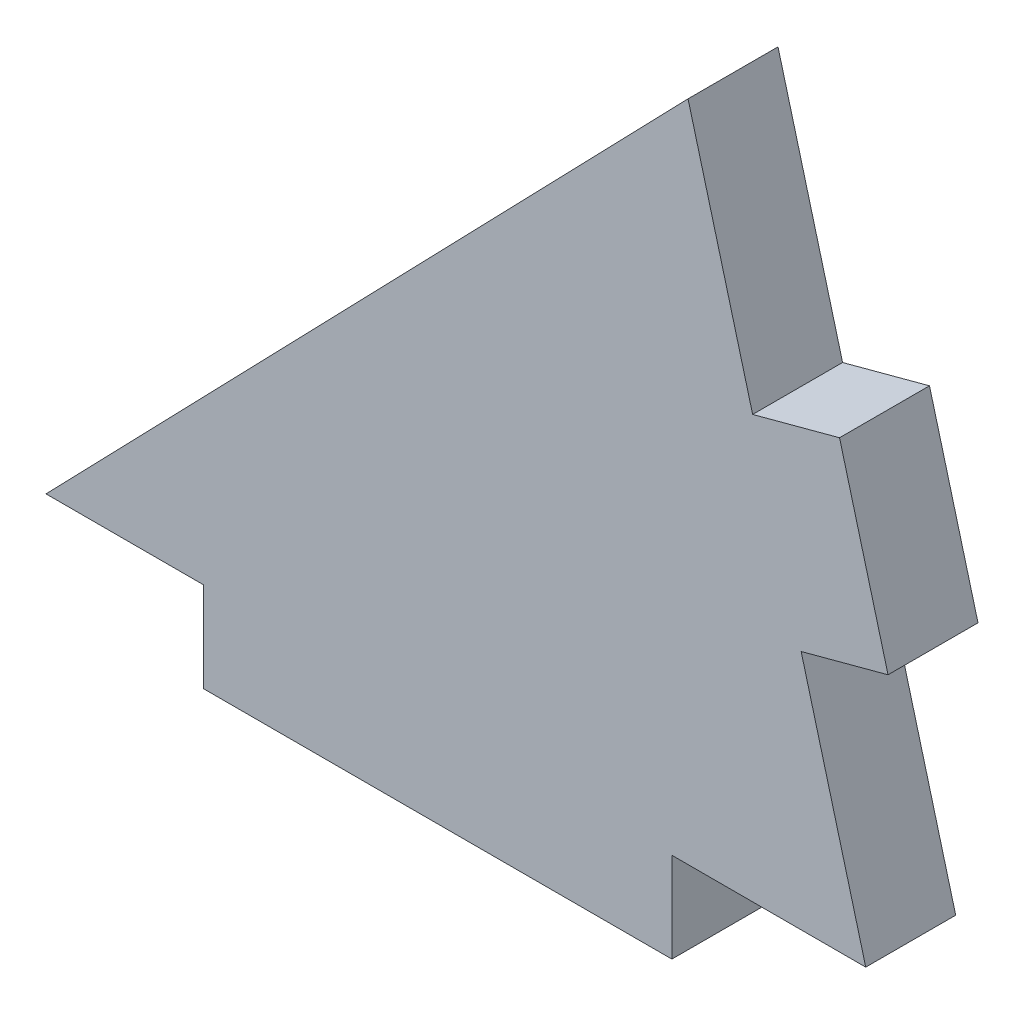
ISO-10303-21;
HEADER;
FILE_DESCRIPTION(('STEP AP214'),'2;1');
FILE_NAME('part.step','',(''),(''),'','','');
FILE_SCHEMA(('AUTOMOTIVE_DESIGN { 1 0 10303 214 1 1 1 1 }'));
ENDSEC;
DATA;
#1=APPLICATION_CONTEXT('core data for automotive mechanical design processes');
#2=APPLICATION_PROTOCOL_DEFINITION('international standard','automotive_design',2000,#1);
#3=PRODUCT_CONTEXT('',#1,'mechanical');
#4=PRODUCT('Part','Part','',(#3));
#5=PRODUCT_RELATED_PRODUCT_CATEGORY('part','',(#4));
#6=PRODUCT_DEFINITION_FORMATION('','',#4);
#7=PRODUCT_DEFINITION_CONTEXT('part definition',#1,'design');
#8=PRODUCT_DEFINITION('design','',#6,#7);
#9=PRODUCT_DEFINITION_SHAPE('','',#8);
#10=(LENGTH_UNIT() NAMED_UNIT(*) SI_UNIT(.MILLI.,.METRE.));
#11=(NAMED_UNIT(*) PLANE_ANGLE_UNIT() SI_UNIT($,.RADIAN.));
#12=(NAMED_UNIT(*) SI_UNIT($,.STERADIAN.) SOLID_ANGLE_UNIT());
#13=UNCERTAINTY_MEASURE_WITH_UNIT(LENGTH_MEASURE(1.E-05),#10,'distance_accuracy_value','');
#14=(GEOMETRIC_REPRESENTATION_CONTEXT(3) GLOBAL_UNCERTAINTY_ASSIGNED_CONTEXT((#13)) GLOBAL_UNIT_ASSIGNED_CONTEXT((#10,
#11,#12)) REPRESENTATION_CONTEXT('',''));
#15=CARTESIAN_POINT('',(0.,0.,0.));
#16=DIRECTION('',(0.,0.,1.));
#17=DIRECTION('',(1.,0.,0.));
#18=AXIS2_PLACEMENT_3D('',#15,#16,#17);
#19=CARTESIAN_POINT('',(18.228516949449,0.,1.524));
#20=DIRECTION('',(0.,1.,0.));
#21=DIRECTION('',(0.,0.,1.));
#22=AXIS2_PLACEMENT_3D('',#19,#20,#21);
#23=PLANE('',#22);
#24=DIRECTION('',(1.,0.,0.));
#25=VECTOR('',#24,1.);
#26=CARTESIAN_POINT('',(18.228516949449,0.,0.));
#27=LINE('',#26,#25);
#28=CARTESIAN_POINT('',(15.5631506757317,0.,0.));
#29=VERTEX_POINT('',#28);
#30=CARTESIAN_POINT('',(18.228516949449,0.,0.));
#31=VERTEX_POINT('',#30);
#32=EDGE_CURVE('E150',#29,#31,#27,.T.);
#33=ORIENTED_EDGE('',*,*,#32,.T.);
#34=DIRECTION('',(0.,0.,-1.));
#35=VECTOR('',#34,1.);
#36=CARTESIAN_POINT('',(18.228516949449,0.,1.524));
#37=LINE('',#36,#35);
#38=CARTESIAN_POINT('',(18.228516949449,0.,1.524));
#39=VERTEX_POINT('',#38);
#40=EDGE_CURVE('E11',#39,#31,#37,.T.);
#41=ORIENTED_EDGE('',*,*,#40,.F.);
#42=DIRECTION('',(1.,0.,0.));
#43=VECTOR('',#42,1.);
#44=CARTESIAN_POINT('',(18.228516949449,0.,1.524));
#45=LINE('',#44,#43);
#46=CARTESIAN_POINT('',(15.5631506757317,0.,1.524));
#47=VERTEX_POINT('',#46);
#48=EDGE_CURVE('E170',#47,#39,#45,.T.);
#49=ORIENTED_EDGE('',*,*,#48,.F.);
#50=DIRECTION('',(0.,0.,-1.));
#51=VECTOR('',#50,1.);
#52=CARTESIAN_POINT('',(15.5631506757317,0.,1.524));
#53=LINE('',#52,#51);
#54=EDGE_CURVE('E146',#47,#29,#53,.T.);
#55=ORIENTED_EDGE('',*,*,#54,.T.);
#56=EDGE_LOOP('',(#33,#41,#49,#55));
#57=FACE_BOUND('',#56,.T.);
#58=ADVANCED_FACE('F36',(#57),#23,.F.);
#59=CARTESIAN_POINT('',(18.228516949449,0.,1.524));
#60=DIRECTION('',(1.,0.,0.));
#61=DIRECTION('',(0.,0.,-1.));
#62=AXIS2_PLACEMENT_3D('',#59,#60,#61);
#63=PLANE('',#62);
#64=DIRECTION('',(0.,-1.,0.));
#65=VECTOR('',#64,1.);
#66=CARTESIAN_POINT('',(18.228516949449,0.,0.));
#67=LINE('',#66,#65);
#68=CARTESIAN_POINT('',(18.228516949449,-1.524,0.));
#69=VERTEX_POINT('',#68);
#70=EDGE_CURVE('E153',#31,#69,#67,.T.);
#71=ORIENTED_EDGE('',*,*,#70,.T.);
#72=DIRECTION('',(0.,0.,-1.));
#73=VECTOR('',#72,1.);
#74=CARTESIAN_POINT('',(18.228516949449,-1.524,1.524));
#75=LINE('',#74,#73);
#76=CARTESIAN_POINT('',(18.228516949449,-1.524,1.524));
#77=VERTEX_POINT('',#76);
#78=EDGE_CURVE('E44',#77,#69,#75,.T.);
#79=ORIENTED_EDGE('',*,*,#78,.F.);
#80=DIRECTION('',(0.,-1.,0.));
#81=VECTOR('',#80,1.);
#82=CARTESIAN_POINT('',(18.228516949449,0.,1.524));
#83=LINE('',#82,#81);
#84=EDGE_CURVE('E104',#39,#77,#83,.T.);
#85=ORIENTED_EDGE('',*,*,#84,.F.);
#86=ORIENTED_EDGE('',*,*,#40,.T.);
#87=EDGE_LOOP('',(#71,#79,#85,#86));
#88=FACE_BOUND('',#87,.T.);
#89=ADVANCED_FACE('F242',(#88),#63,.F.);
#90=CARTESIAN_POINT('',(18.228516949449,-1.524,1.524));
#91=DIRECTION('',(0.,1.,0.));
#92=DIRECTION('',(0.,0.,1.));
#93=AXIS2_PLACEMENT_3D('',#90,#91,#92);
#94=PLANE('',#93);
#95=DIRECTION('',(1.,0.,0.));
#96=VECTOR('',#95,1.);
#97=CARTESIAN_POINT('',(18.228516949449,-1.524,0.));
#98=LINE('',#97,#96);
#99=CARTESIAN_POINT('',(26.166016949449,-1.524,0.));
#100=VERTEX_POINT('',#99);
#101=EDGE_CURVE('E155',#69,#100,#98,.T.);
#102=ORIENTED_EDGE('',*,*,#101,.T.);
#103=DIRECTION('',(0.,0.,-1.));
#104=VECTOR('',#103,1.);
#105=CARTESIAN_POINT('',(26.166016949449,-1.524,1.524));
#106=LINE('',#105,#104);
#107=CARTESIAN_POINT('',(26.166016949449,-1.524,1.524));
#108=VERTEX_POINT('',#107);
#109=EDGE_CURVE('E186',#108,#100,#106,.T.);
#110=ORIENTED_EDGE('',*,*,#109,.F.);
#111=DIRECTION('',(1.,0.,0.));
#112=VECTOR('',#111,1.);
#113=CARTESIAN_POINT('',(18.228516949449,-1.524,1.524));
#114=LINE('',#113,#112);
#115=EDGE_CURVE('E194',#77,#108,#114,.T.);
#116=ORIENTED_EDGE('',*,*,#115,.F.);
#117=ORIENTED_EDGE('',*,*,#78,.T.);
#118=EDGE_LOOP('',(#102,#110,#116,#117));
#119=FACE_BOUND('',#118,.T.);
#120=ADVANCED_FACE('F192',(#119),#94,.F.);
#121=CARTESIAN_POINT('',(26.166016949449,-1.524,1.524));
#122=DIRECTION('',(-1.,0.,0.));
#123=DIRECTION('',(0.,0.,1.));
#124=AXIS2_PLACEMENT_3D('',#121,#122,#123);
#125=PLANE('',#124);
#126=DIRECTION('',(0.,1.,0.));
#127=VECTOR('',#126,1.);
#128=CARTESIAN_POINT('',(26.166016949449,-1.524,0.));
#129=LINE('',#128,#127);
#130=CARTESIAN_POINT('',(26.166016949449,0.,0.));
#131=VERTEX_POINT('',#130);
#132=EDGE_CURVE('E157',#100,#131,#129,.T.);
#133=ORIENTED_EDGE('',*,*,#132,.T.);
#134=DIRECTION('',(0.,0.,-1.));
#135=VECTOR('',#134,1.);
#136=CARTESIAN_POINT('',(26.166016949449,0.,1.524));
#137=LINE('',#136,#135);
#138=CARTESIAN_POINT('',(26.166016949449,0.,1.524));
#139=VERTEX_POINT('',#138);
#140=EDGE_CURVE('E183',#139,#131,#137,.T.);
#141=ORIENTED_EDGE('',*,*,#140,.F.);
#142=DIRECTION('',(0.,1.,0.));
#143=VECTOR('',#142,1.);
#144=CARTESIAN_POINT('',(26.166016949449,-1.524,1.524));
#145=LINE('',#144,#143);
#146=EDGE_CURVE('E212',#108,#139,#145,.T.);
#147=ORIENTED_EDGE('',*,*,#146,.F.);
#148=ORIENTED_EDGE('',*,*,#109,.T.);
#149=EDGE_LOOP('',(#133,#141,#147,#148));
#150=FACE_BOUND('',#149,.T.);
#151=ADVANCED_FACE('F203',(#150),#125,.F.);
#152=CARTESIAN_POINT('',(26.166016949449,0.,1.524));
#153=DIRECTION('',(0.,1.,0.));
#154=DIRECTION('',(0.,0.,1.));
#155=AXIS2_PLACEMENT_3D('',#152,#153,#154);
#156=PLANE('',#155);
#157=DIRECTION('',(1.,0.,0.));
#158=VECTOR('',#157,1.);
#159=CARTESIAN_POINT('',(26.166016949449,0.,0.));
#160=LINE('',#159,#158);
#161=CARTESIAN_POINT('',(29.4500890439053,0.,0.));
#162=VERTEX_POINT('',#161);
#163=EDGE_CURVE('E159',#131,#162,#160,.T.);
#164=ORIENTED_EDGE('',*,*,#163,.T.);
#165=DIRECTION('',(0.,0.,-1.));
#166=VECTOR('',#165,1.);
#167=CARTESIAN_POINT('',(29.4500890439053,0.,1.524));
#168=LINE('',#167,#166);
#169=CARTESIAN_POINT('',(29.4500890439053,0.,1.524));
#170=VERTEX_POINT('',#169);
#171=EDGE_CURVE('E180',#170,#162,#168,.T.);
#172=ORIENTED_EDGE('',*,*,#171,.F.);
#173=DIRECTION('',(1.,0.,0.));
#174=VECTOR('',#173,1.);
#175=CARTESIAN_POINT('',(26.166016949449,0.,1.524));
#176=LINE('',#175,#174);
#177=EDGE_CURVE('E209',#139,#170,#176,.T.);
#178=ORIENTED_EDGE('',*,*,#177,.F.);
#179=ORIENTED_EDGE('',*,*,#140,.T.);
#180=EDGE_LOOP('',(#164,#172,#178,#179));
#181=FACE_BOUND('',#180,.T.);
#182=ADVANCED_FACE('F207',(#181),#156,.F.);
#183=CARTESIAN_POINT('',(29.4500890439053,0.,1.524));
#184=DIRECTION('',(-0.965925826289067,-0.258819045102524,0.));
#185=DIRECTION('',(0.258819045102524,-0.965925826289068,0.));
#186=AXIS2_PLACEMENT_3D('',#183,#184,#185);
#187=PLANE('',#186);
#188=DIRECTION('',(-0.258819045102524,0.965925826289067,0.));
#189=VECTOR('',#188,1.);
#190=CARTESIAN_POINT('',(29.4500890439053,0.,0.));
#191=LINE('',#190,#189);
#192=CARTESIAN_POINT('',(28.3557800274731,4.08401684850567,0.));
#193=VERTEX_POINT('',#192);
#194=EDGE_CURVE('E161',#162,#193,#191,.T.);
#195=ORIENTED_EDGE('',*,*,#194,.T.);
#196=DIRECTION('',(0.,0.,-1.));
#197=VECTOR('',#196,1.);
#198=CARTESIAN_POINT('',(28.3557800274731,4.08401684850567,1.524));
#199=LINE('',#198,#197);
#200=CARTESIAN_POINT('',(28.3557800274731,4.08401684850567,1.524));
#201=VERTEX_POINT('',#200);
#202=EDGE_CURVE('E177',#201,#193,#199,.T.);
#203=ORIENTED_EDGE('',*,*,#202,.F.);
#204=DIRECTION('',(-0.258819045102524,0.965925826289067,0.));
#205=VECTOR('',#204,1.);
#206=CARTESIAN_POINT('',(29.4500890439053,0.,1.524));
#207=LINE('',#206,#205);
#208=EDGE_CURVE('E211',#170,#201,#207,.T.);
#209=ORIENTED_EDGE('',*,*,#208,.F.);
#210=ORIENTED_EDGE('',*,*,#171,.T.);
#211=EDGE_LOOP('',(#195,#203,#209,#210));
#212=FACE_BOUND('',#211,.T.);
#213=ADVANCED_FACE('F255',(#212),#187,.F.);
#214=CARTESIAN_POINT('',(28.3557800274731,4.08401684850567,1.524));
#215=DIRECTION('',(-0.258819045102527,0.965925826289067,0.));
#216=DIRECTION('',(-0.965925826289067,-0.258819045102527,0.));
#217=AXIS2_PLACEMENT_3D('',#214,#215,#216);
#218=PLANE('',#217);
#219=DIRECTION('',(0.965925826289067,0.258819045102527,0.));
#220=VECTOR('',#219,1.);
#221=CARTESIAN_POINT('',(28.3557800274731,4.08401684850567,0.));
#222=LINE('',#221,#220);
#223=CARTESIAN_POINT('',(29.8278509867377,4.47845707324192,0.));
#224=VERTEX_POINT('',#223);
#225=EDGE_CURVE('E163',#193,#224,#222,.T.);
#226=ORIENTED_EDGE('',*,*,#225,.T.);
#227=DIRECTION('',(0.,0.,-1.));
#228=VECTOR('',#227,1.);
#229=CARTESIAN_POINT('',(29.8278509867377,4.47845707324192,1.524));
#230=LINE('',#229,#228);
#231=CARTESIAN_POINT('',(29.8278509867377,4.47845707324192,1.524));
#232=VERTEX_POINT('',#231);
#233=EDGE_CURVE('E174',#232,#224,#230,.T.);
#234=ORIENTED_EDGE('',*,*,#233,.F.);
#235=DIRECTION('',(0.965925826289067,0.258819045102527,0.));
#236=VECTOR('',#235,1.);
#237=CARTESIAN_POINT('',(28.3557800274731,4.08401684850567,1.524));
#238=LINE('',#237,#236);
#239=EDGE_CURVE('E214',#201,#232,#238,.T.);
#240=ORIENTED_EDGE('',*,*,#239,.F.);
#241=ORIENTED_EDGE('',*,*,#202,.T.);
#242=EDGE_LOOP('',(#226,#234,#240,#241));
#243=FACE_BOUND('',#242,.T.);
#244=ADVANCED_FACE('F223',(#243),#218,.F.);
#245=CARTESIAN_POINT('',(29.8278509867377,4.47845707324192,1.524));
#246=DIRECTION('',(-0.965925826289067,-0.258819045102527,0.));
#247=DIRECTION('',(0.258819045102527,-0.965925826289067,0.));
#248=AXIS2_PLACEMENT_3D('',#245,#246,#247);
#249=PLANE('',#248);
#250=DIRECTION('',(-0.258819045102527,0.965925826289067,0.));
#251=VECTOR('',#250,1.);
#252=CARTESIAN_POINT('',(29.8278509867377,4.47845707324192,0.));
#253=LINE('',#252,#251);
#254=CARTESIAN_POINT('',(29.0061005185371,7.54527157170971,0.));
#255=VERTEX_POINT('',#254);
#256=EDGE_CURVE('E165',#224,#255,#253,.T.);
#257=ORIENTED_EDGE('',*,*,#256,.T.);
#258=DIRECTION('',(0.,0.,-1.));
#259=VECTOR('',#258,1.);
#260=CARTESIAN_POINT('',(29.0061005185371,7.54527157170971,1.524));
#261=LINE('',#260,#259);
#262=CARTESIAN_POINT('',(29.0061005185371,7.54527157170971,1.524));
#263=VERTEX_POINT('',#262);
#264=EDGE_CURVE('E141',#263,#255,#261,.T.);
#265=ORIENTED_EDGE('',*,*,#264,.F.);
#266=DIRECTION('',(-0.258819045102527,0.965925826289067,0.));
#267=VECTOR('',#266,1.);
#268=CARTESIAN_POINT('',(29.8278509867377,4.47845707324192,1.524));
#269=LINE('',#268,#267);
#270=EDGE_CURVE('E132',#232,#263,#269,.T.);
#271=ORIENTED_EDGE('',*,*,#270,.F.);
#272=ORIENTED_EDGE('',*,*,#233,.T.);
#273=EDGE_LOOP('',(#257,#265,#271,#272));
#274=FACE_BOUND('',#273,.T.);
#275=ADVANCED_FACE('F227',(#274),#249,.F.);
#276=CARTESIAN_POINT('',(27.5340295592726,7.15083134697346,1.524));
#277=DIRECTION('',(0.258819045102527,-0.965925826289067,0.));
#278=DIRECTION('',(0.965925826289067,0.258819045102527,0.));
#279=AXIS2_PLACEMENT_3D('',#276,#277,#278);
#280=PLANE('',#279);
#281=DIRECTION('',(-0.965925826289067,-0.258819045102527,0.));
#282=VECTOR('',#281,1.);
#283=CARTESIAN_POINT('',(27.5340295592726,7.15083134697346,0.));
#284=LINE('',#283,#282);
#285=CARTESIAN_POINT('',(27.5340295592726,7.15083134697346,0.));
#286=VERTEX_POINT('',#285);
#287=EDGE_CURVE('E140',#255,#286,#284,.T.);
#288=ORIENTED_EDGE('',*,*,#287,.T.);
#289=DIRECTION('',(0.,0.,-1.));
#290=VECTOR('',#289,1.);
#291=CARTESIAN_POINT('',(27.5340295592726,7.15083134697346,1.524));
#292=LINE('',#291,#290);
#293=CARTESIAN_POINT('',(27.5340295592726,7.15083134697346,1.524));
#294=VERTEX_POINT('',#293);
#295=EDGE_CURVE('E137',#294,#286,#292,.T.);
#296=ORIENTED_EDGE('',*,*,#295,.F.);
#297=DIRECTION('',(-0.965925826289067,-0.258819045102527,0.));
#298=VECTOR('',#297,1.);
#299=CARTESIAN_POINT('',(27.5340295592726,7.15083134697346,1.524));
#300=LINE('',#299,#298);
#301=EDGE_CURVE('E126',#263,#294,#300,.T.);
#302=ORIENTED_EDGE('',*,*,#301,.F.);
#303=ORIENTED_EDGE('',*,*,#264,.T.);
#304=EDGE_LOOP('',(#288,#296,#302,#303));
#305=FACE_BOUND('',#304,.T.);
#306=ADVANCED_FACE('F138',(#305),#280,.F.);
#307=CARTESIAN_POINT('',(27.5340295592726,7.15083134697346,1.524));
#308=DIRECTION('',(-0.965925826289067,-0.258819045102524,0.));
#309=DIRECTION('',(0.258819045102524,-0.965925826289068,0.));
#310=AXIS2_PLACEMENT_3D('',#307,#308,#309);
#311=PLANE('',#310);
#312=DIRECTION('',(-0.258819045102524,0.965925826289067,0.));
#313=VECTOR('',#312,1.);
#314=CARTESIAN_POINT('',(27.5340295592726,7.15083134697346,0.));
#315=LINE('',#314,#313);
#316=CARTESIAN_POINT('',(26.4397205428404,11.2348481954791,0.));
#317=VERTEX_POINT('',#316);
#318=EDGE_CURVE('E90',#286,#317,#315,.T.);
#319=ORIENTED_EDGE('',*,*,#318,.T.);
#320=DIRECTION('',(0.,0.,-1.));
#321=VECTOR('',#320,1.);
#322=CARTESIAN_POINT('',(26.4397205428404,11.2348481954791,1.524));
#323=LINE('',#322,#321);
#324=CARTESIAN_POINT('',(26.4397205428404,11.2348481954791,1.524));
#325=VERTEX_POINT('',#324);
#326=EDGE_CURVE('E142',#325,#317,#323,.T.);
#327=ORIENTED_EDGE('',*,*,#326,.F.);
#328=DIRECTION('',(-0.258819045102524,0.965925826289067,0.));
#329=VECTOR('',#328,1.);
#330=CARTESIAN_POINT('',(27.5340295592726,7.15083134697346,1.524));
#331=LINE('',#330,#329);
#332=EDGE_CURVE('E130',#294,#325,#331,.T.);
#333=ORIENTED_EDGE('',*,*,#332,.F.);
#334=ORIENTED_EDGE('',*,*,#295,.T.);
#335=EDGE_LOOP('',(#319,#327,#333,#334));
#336=FACE_BOUND('',#335,.T.);
#337=ADVANCED_FACE('F144',(#336),#311,.F.);
#338=CARTESIAN_POINT('',(15.5631506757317,0.,1.524));
#339=DIRECTION('',(0.718469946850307,-0.695558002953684,0.));
#340=DIRECTION('',(0.695558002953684,0.718469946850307,0.));
#341=AXIS2_PLACEMENT_3D('',#338,#339,#340);
#342=PLANE('',#341);
#343=DIRECTION('',(-0.695558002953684,-0.718469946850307,0.));
#344=VECTOR('',#343,1.);
#345=CARTESIAN_POINT('',(15.5631506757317,0.,0.));
#346=LINE('',#345,#344);
#347=EDGE_CURVE('E96',#317,#29,#346,.T.);
#348=ORIENTED_EDGE('',*,*,#347,.T.);
#349=ORIENTED_EDGE('',*,*,#54,.F.);
#350=DIRECTION('',(-0.695558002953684,-0.718469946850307,0.));
#351=VECTOR('',#350,1.);
#352=CARTESIAN_POINT('',(15.5631506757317,0.,1.524));
#353=LINE('',#352,#351);
#354=EDGE_CURVE('E52',#325,#47,#353,.T.);
#355=ORIENTED_EDGE('',*,*,#354,.F.);
#356=ORIENTED_EDGE('',*,*,#326,.T.);
#357=EDGE_LOOP('',(#348,#349,#355,#356));
#358=FACE_BOUND('',#357,.T.);
#359=ADVANCED_FACE('F231',(#358),#342,.F.);
#360=CARTESIAN_POINT('',(0.,0.,1.524));
#361=DIRECTION('',(0.,0.,-1.));
#362=DIRECTION('',(-1.,0.,0.));
#363=AXIS2_PLACEMENT_3D('',#360,#361,#362);
#364=PLANE('',#363);
#365=ORIENTED_EDGE('',*,*,#48,.T.);
#366=ORIENTED_EDGE('',*,*,#84,.T.);
#367=ORIENTED_EDGE('',*,*,#115,.T.);
#368=ORIENTED_EDGE('',*,*,#146,.T.);
#369=ORIENTED_EDGE('',*,*,#177,.T.);
#370=ORIENTED_EDGE('',*,*,#208,.T.);
#371=ORIENTED_EDGE('',*,*,#239,.T.);
#372=ORIENTED_EDGE('',*,*,#270,.T.);
#373=ORIENTED_EDGE('',*,*,#301,.T.);
#374=ORIENTED_EDGE('',*,*,#332,.T.);
#375=ORIENTED_EDGE('',*,*,#354,.T.);
#376=EDGE_LOOP('',(#365,#366,#367,#368,#369,#370,#371,#372,#373,#374,#375));
#377=FACE_BOUND('',#376,.T.);
#378=ADVANCED_FACE('F128',(#377),#364,.F.);
#379=CARTESIAN_POINT('',(0.,0.,0.));
#380=DIRECTION('',(0.,0.,-1.));
#381=DIRECTION('',(-1.,0.,0.));
#382=AXIS2_PLACEMENT_3D('',#379,#380,#381);
#383=PLANE('',#382);
#384=ORIENTED_EDGE('',*,*,#32,.F.);
#385=ORIENTED_EDGE('',*,*,#347,.F.);
#386=ORIENTED_EDGE('',*,*,#318,.F.);
#387=ORIENTED_EDGE('',*,*,#287,.F.);
#388=ORIENTED_EDGE('',*,*,#256,.F.);
#389=ORIENTED_EDGE('',*,*,#225,.F.);
#390=ORIENTED_EDGE('',*,*,#194,.F.);
#391=ORIENTED_EDGE('',*,*,#163,.F.);
#392=ORIENTED_EDGE('',*,*,#132,.F.);
#393=ORIENTED_EDGE('',*,*,#101,.F.);
#394=ORIENTED_EDGE('',*,*,#70,.F.);
#395=EDGE_LOOP('',(#384,#385,#386,#387,#388,#389,#390,#391,#392,#393,#394));
#396=FACE_BOUND('',#395,.T.);
#397=ADVANCED_FACE('F198',(#396),#383,.T.);
#398=CLOSED_SHELL('',(#58,#89,#120,#151,#182,#213,#244,#275,#306,#337,#359,#378,#397));
#399=MANIFOLD_SOLID_BREP('B2',#398);
#400=ADVANCED_BREP_SHAPE_REPRESENTATION('',(#18,#399),#14);
#401=SHAPE_DEFINITION_REPRESENTATION(#9,#400);
ENDSEC;
END-ISO-10303-21;
